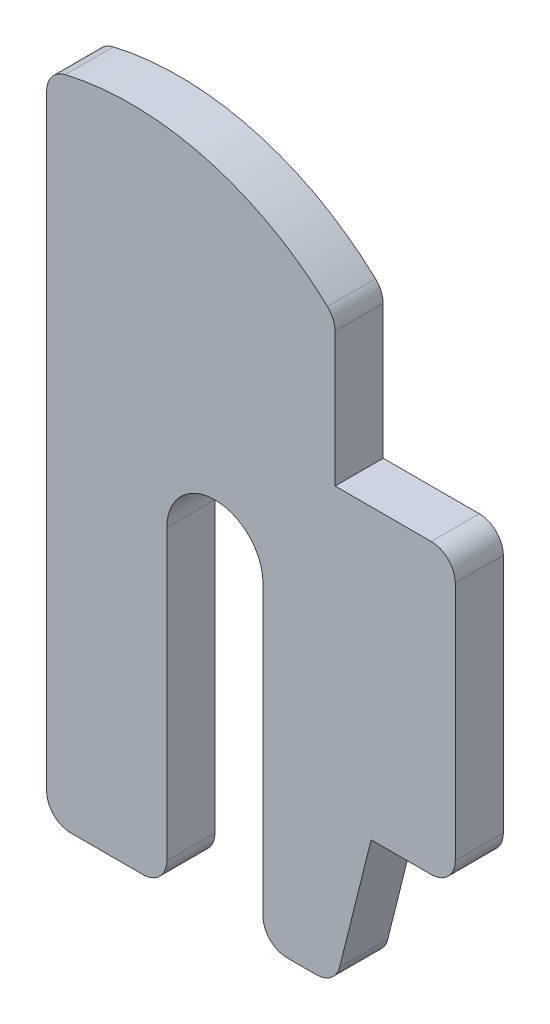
from build123d import *

# Parameters (mm, degrees)
RESSALTO_EXTRUS_O1_DEPTH = 2


with BuildPart() as part:
    # Esbo_o1 → Ressalto-extrus_o1 (new body)
    with BuildSketch(Plane.XY):
        with BuildLine():
            Line((0, 1), (0, 26.234323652))
            ThreePointArc((0, 26.234323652), (0.216479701, 26.855689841), (0.772191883, 27.208029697))
            ThreePointArc((0.772191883, 27.208029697), (6.58904443, 27.120718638), (11.681282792, 24.30780107))
            ThreePointArc((11.681282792, 24.30780107), (11.916864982, 23.974978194), (12, 23.575780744))
            Line((12, 23.575780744), (12, 18))
            Line((12, 18), (16, 18))
            ThreePointArc((16, 18), (16.707106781, 17.707106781), (17, 17))
            Line((17, 17), (17, 7))
            ThreePointArc((17, 7), (16.707106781, 6.292893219), (16, 6))
            Line((16, 6), (13.5, 6))
            Line((13.5, 6), (12.189366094, 0.757464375))
            ThreePointArc((12.189366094, 0.757464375), (11.834635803, 0.211794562), (11.219223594, 0))
            Line((11.219223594, 0), (10, 0))
            ThreePointArc((10, 0), (9.292893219, 0.292893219), (9, 1))
            Line((9, 1), (9, 13))
            ThreePointArc((9, 13), (7, 15), (5, 13))
            Line((5, 13), (5, 1))
            ThreePointArc((5, 1), (4.707106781, 0.292893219), (4, 0))
            Line((4, 0), (1, 0))
            ThreePointArc((1, 0), (0.292893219, 0.292893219), (0, 1))
        make_face()
    extrude(amount=RESSALTO_EXTRUS_O1_DEPTH)


solid = part.part
